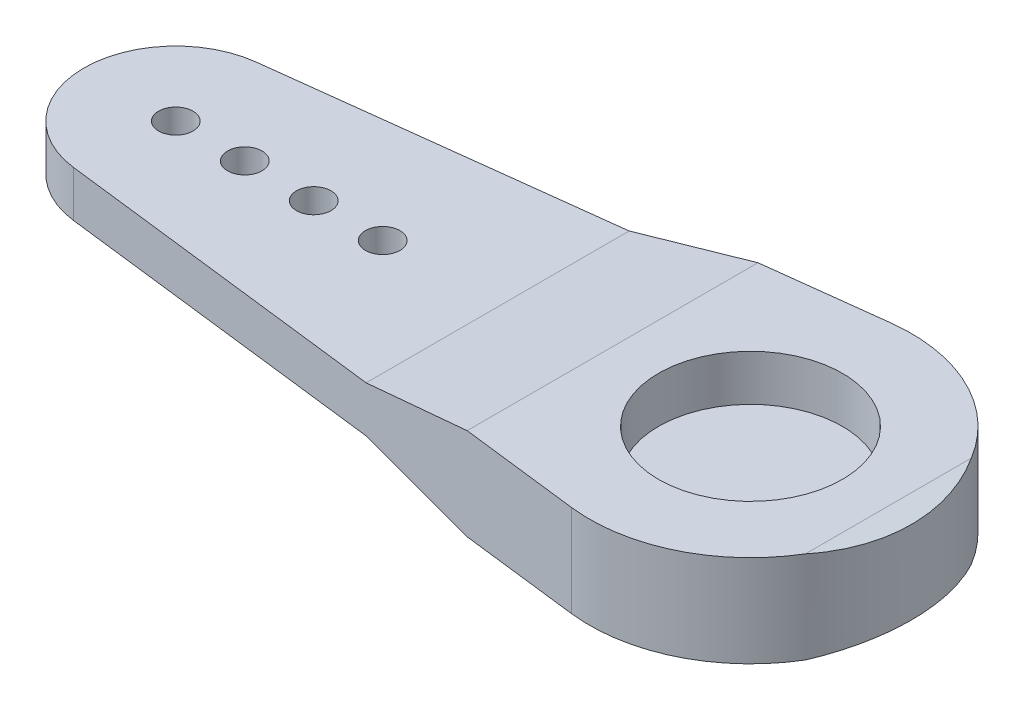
from build123d import *

# Parameters (mm, degrees)
EXTRUSION6_DEPTH        = 30
ESQUISSE8_W             = 60
ESQUISSE8_H             = 30
ENL_V_MAT_EXTRU_4_DEPTH = 43.614551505
ESQUISSE9_R             = 4
ENL_V_MAT_EXTRU_5_DEPTH = 2
ESQUISSE10_R            = 5
EXTRUSION7_DEPTH        = 0.5
ESQUISSE11_R            = 5
EXTRUSION8_DEPTH        = 1.5
EXTRUSION8_TAPER        = 45
ESQUISSE12_R            = 0.75
ENL_V_MAT_EXTRU_6_DEPTH = 37.742346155
ESQUISSE13_R            = 2.9
EXTRUSION9_DEPTH        = 2.7


with BuildPart() as part:
    # Esquisse1 → Extrusion6 (new body)
    with BuildSketch(Plane.XY):
        Polygon((-30, 3), (-11, 3), (-6, 4), (6, 4), (11, 3), (30, 3), (30, 1), (11, 1), (6, 0), (-6, 0), (-11, 1), (-30, 1), align=None)
    extrude(amount=EXTRUSION6_DEPTH)

    # Esquisse8 → Enl_v. mat.-Extru.4 (cut, through all)
    with BuildSketch(Plane(origin=(0, 4, 0), x_dir=(1, 0, 0), z_dir=(0, 1, 0))):
        with Locations((0, -15)):
            Rectangle(ESQUISSE8_W, ESQUISSE8_H)
        with BuildLine():
            Line((-25.48, -11.028904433), (-0.84, -8.050582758))
            ThreePointArc((-0.84, -8.050582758), (7, -15), (-0.84, -21.949417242))
            Line((-0.84, -21.949417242), (-25.48, -18.971095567))
            ThreePointArc((-25.48, -18.971095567), (-29, -15), (-25.48, -11.028904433))
        make_face(mode=Mode.SUBTRACT)
    extrude(amount=-ENL_V_MAT_EXTRU_4_DEPTH, mode=Mode.SUBTRACT)

    # Esquisse9 → Enl_v. mat.-Extru.5 (cut)
    with BuildSketch(Plane(origin=(0, 4, 0), x_dir=(1, 0, 0), z_dir=(0, 1, 0))):
        with Locations(Location((0, -15, 0), (0, 0, 270))):
            Circle(ESQUISSE9_R)
    extrude(amount=-ENL_V_MAT_EXTRU_5_DEPTH, mode=Mode.SUBTRACT)

    # Esquisse10 → Extrusion7 (add)
    with BuildSketch(Plane.XZ):
        with Locations(Location((0, 15, 0), (0, 0, 90))):
            Circle(ESQUISSE10_R)
    extrude(amount=EXTRUSION7_DEPTH)

    # Esquisse11 → Extrusion8 (add)
    with BuildSketch(Plane.XZ.offset(0.5)):
        with Locations(Location((0, 15, 0), (0, 0, 90))):
            Circle(ESQUISSE11_R)
    extrude(amount=EXTRUSION8_DEPTH, taper=EXTRUSION8_TAPER)

    # Esquisse12 → Enl_v. mat.-Extru.6 (cut, through all)
    with BuildSketch(Plane(origin=(0, 3, 0), x_dir=(1, 0, 0), z_dir=(0, 1, 0))):
        with Locations(Location((-16, -15, 0), (0, 0, 270))):
            Circle(ESQUISSE12_R)
        with Locations(Location((-19, -15, 0), (0, 0, 270))):
            Circle(ESQUISSE12_R)
        with Locations(Location((-22, -15, 0), (0, 0, 270))):
            Circle(ESQUISSE12_R)
        with Locations(Location((-25, -15, 0), (0, 0, 270))):
            Circle(ESQUISSE12_R)
    extrude(amount=-ENL_V_MAT_EXTRU_6_DEPTH, mode=Mode.SUBTRACT)

    # Esquisse13 → Extrusion9 (cut)
    with BuildSketch(Plane.XZ.offset(2)):
        with Locations(Location((0, 15, 0), (0, 0, 270))):
            Circle(ESQUISSE13_R)
    extrude(amount=-EXTRUSION9_DEPTH, mode=Mode.SUBTRACT)


solid = part.part
